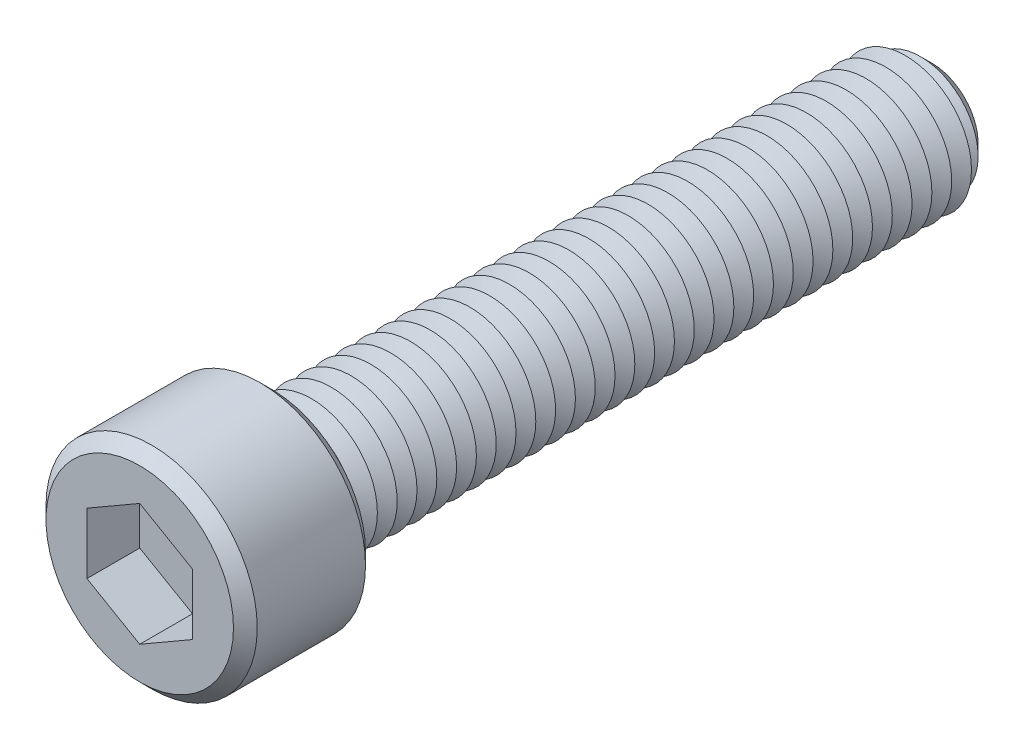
from build123d import *

# Parameters (mm, degrees)
SKETCH1_R           = 8
BOSS_EXTRUDE1_DEPTH = 10
SKETCH2_R           = 5
BOSS_EXTRUDE2_DEPTH = 50
CHAMFER1_SIZE       = 1.5
LPATTERN1_COUNT     = 33
LPATTERN1_PITCH     = 1.5
CUT_EXTRUDE1_DEPTH  = 4
SKETCH6_R           = 0.9
CUT_EXTRUDE2_DEPTH  = 56
CHAMFER2_SIZE       = 0.9


with BuildPart() as part:
    # Sketch1 → Boss-Extrude1 (new body)
    with BuildSketch(Plane.XY):
        Circle(SKETCH1_R)
    extrude(amount=BOSS_EXTRUDE1_DEPTH)

    # Sketch2 → Boss-Extrude2 (add)
    with BuildSketch(Plane(origin=(0, 0, 0), x_dir=(-1, 0, 0), z_dir=(0, 0, -1))):
        Circle(SKETCH2_R)
    extrude(amount=BOSS_EXTRUDE2_DEPTH)

    # Chamfer1
    chamfer1_edges = [part.edges().sort_by_distance(p)[0] for p in [
        (5, 0, -50),
    ]]
    chamfer(chamfer1_edges, length=CHAMFER1_SIZE)

    # Sketch4 → Cut-Revolve1 (revolve, cut)
    with BuildSketch(Plane(origin=(0, 0, 0), x_dir=(0, 0, -1), z_dir=(1, 0, 0)), mode=Mode.PRIVATE) as cut_revolve1_sk:
        Polygon((0, 5), (0.75, 3.700961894), (1.5, 5), align=None)
    cut_revolve1 = revolve(cut_revolve1_sk.sketch.rotate(Axis((0, 0, 2.512122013), (0, 0, -1)), 90), axis=Axis((0, 0, 2.512122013), (0, 0, -1)), mode=Mode.SUBTRACT)

    # LPattern1: Cut-Revolve1 ×33
    with Locations(*[(0, 0, -i * LPATTERN1_PITCH) for i in range(1, LPATTERN1_COUNT)]):
        add(cut_revolve1, mode=Mode.SUBTRACT)

    # Sketch5 → Cut-Extrude1 (cut)
    with BuildSketch(Plane.XY.offset(10)):
        Polygon((0, 4.618802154), (-4, 2.309401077), (-4, -2.309401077), (0, -4.618802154), (4, -2.309401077), (4, 2.309401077), align=None)
    extrude(amount=-CUT_EXTRUDE1_DEPTH, mode=Mode.SUBTRACT)

    # Sketch6 → Cut-Extrude2 (cut)
    with BuildSketch(Plane.XY.offset(6)):
        Circle(SKETCH6_R)
    extrude(amount=-CUT_EXTRUDE2_DEPTH, mode=Mode.SUBTRACT)

    # Chamfer2
    chamfer2_edges = [part.edges().sort_by_distance(p)[0] for p in [
        (-8, 0, 0),
        (-8, 0, 10),
    ]]
    chamfer(chamfer2_edges, length=CHAMFER2_SIZE)


solid = part.part
